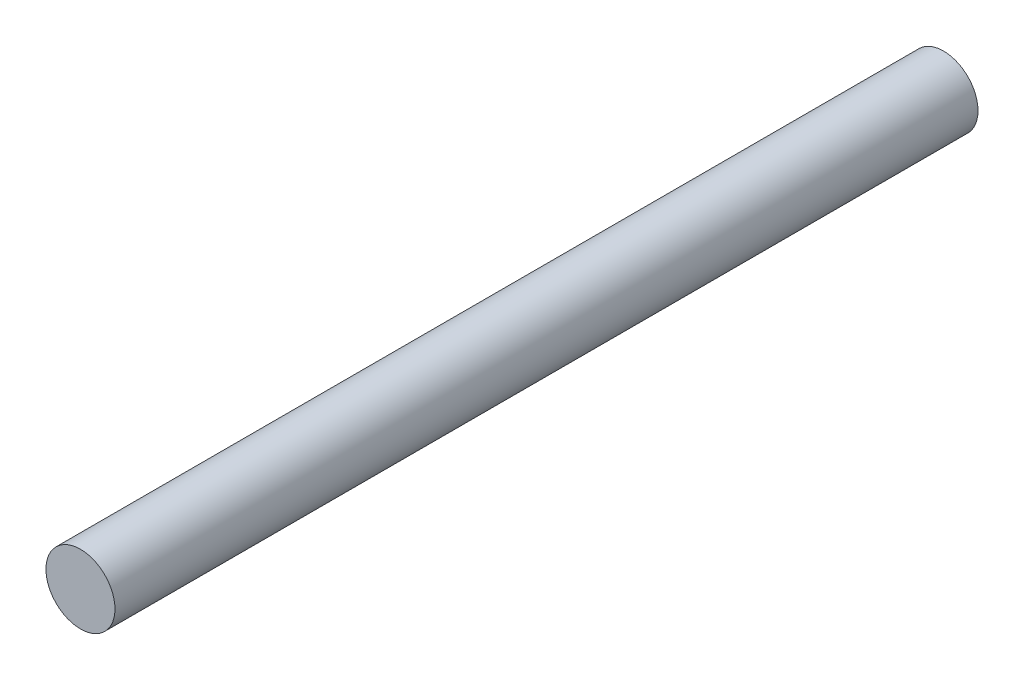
ISO-10303-21;
HEADER;
FILE_DESCRIPTION(('STEP AP214'),'2;1');
FILE_NAME('part.step','',(''),(''),'','','');
FILE_SCHEMA(('AUTOMOTIVE_DESIGN { 1 0 10303 214 1 1 1 1 }'));
ENDSEC;
DATA;
#1=APPLICATION_CONTEXT('core data for automotive mechanical design processes');
#2=APPLICATION_PROTOCOL_DEFINITION('international standard','automotive_design',2000,#1);
#3=PRODUCT_CONTEXT('',#1,'mechanical');
#4=PRODUCT('Part','Part','',(#3));
#5=PRODUCT_RELATED_PRODUCT_CATEGORY('part','',(#4));
#6=PRODUCT_DEFINITION_FORMATION('','',#4);
#7=PRODUCT_DEFINITION_CONTEXT('part definition',#1,'design');
#8=PRODUCT_DEFINITION('design','',#6,#7);
#9=PRODUCT_DEFINITION_SHAPE('','',#8);
#10=(LENGTH_UNIT() NAMED_UNIT(*) SI_UNIT(.MILLI.,.METRE.));
#11=(NAMED_UNIT(*) PLANE_ANGLE_UNIT() SI_UNIT($,.RADIAN.));
#12=(NAMED_UNIT(*) SI_UNIT($,.STERADIAN.) SOLID_ANGLE_UNIT());
#13=UNCERTAINTY_MEASURE_WITH_UNIT(LENGTH_MEASURE(1.E-05),#10,'distance_accuracy_value','');
#14=(GEOMETRIC_REPRESENTATION_CONTEXT(3) GLOBAL_UNCERTAINTY_ASSIGNED_CONTEXT((#13)) GLOBAL_UNIT_ASSIGNED_CONTEXT((#10,
#11,#12)) REPRESENTATION_CONTEXT('',''));
#15=CARTESIAN_POINT('',(0.,0.,0.));
#16=DIRECTION('',(0.,0.,1.));
#17=DIRECTION('',(1.,0.,0.));
#18=AXIS2_PLACEMENT_3D('',#15,#16,#17);
#19=CARTESIAN_POINT('',(4.9960036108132E-13,-1.99840144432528E-12,-1269.99999999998));
#20=DIRECTION('',(0.,0.,0.999999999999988));
#21=DIRECTION('',(0.999999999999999,0.,0.));
#22=AXIS2_PLACEMENT_3D('',#19,#20,#21);
#23=CYLINDRICAL_SURFACE('',#22,50.8);
#24=CARTESIAN_POINT('',(4.9960036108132E-13,-1.99840144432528E-12,-1269.99999999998));
#25=DIRECTION('',(0.,0.,0.999999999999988));
#26=DIRECTION('',(0.999999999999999,0.,0.));
#27=AXIS2_PLACEMENT_3D('',#24,#25,#26);
#28=CIRCLE('',#27,50.8);
#29=CARTESIAN_POINT('',(50.8000000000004,-1.99840365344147E-12,-1269.99999999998));
#30=VERTEX_POINT('',#29);
#31=EDGE_CURVE('E10',#30,#30,#28,.T.);
#32=CARTESIAN_POINT('',(0.,0.,0.));
#33=DIRECTION('',(0.,0.,0.999999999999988));
#34=DIRECTION('',(0.999999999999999,0.,0.));
#35=AXIS2_PLACEMENT_3D('',#32,#33,#34);
#36=CIRCLE('',#35,50.8);
#37=CARTESIAN_POINT('',(50.8000000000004,-1.99840365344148E-12,2.22044604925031E-13));
#38=VERTEX_POINT('',#37);
#39=EDGE_CURVE('E354',#38,#38,#36,.T.);
#40=CARTESIAN_POINT('',(50.8000000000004,-1.99840365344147E-12,-1269.99999999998));
#41=CARTESIAN_POINT('',(50.8000000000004,-1.99840365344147E-12,-1256.77083333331));
#42=CARTESIAN_POINT('',(50.8000000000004,-1.99840365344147E-12,-1243.54166666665));
#43=CARTESIAN_POINT('',(50.8000000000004,-1.99840365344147E-12,-1217.08333333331));
#44=CARTESIAN_POINT('',(50.8000000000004,-1.99840365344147E-12,-1203.85416666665));
#45=CARTESIAN_POINT('',(50.8000000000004,-1.99840365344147E-12,-1177.39583333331));
#46=CARTESIAN_POINT('',(50.8000000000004,-1.99840365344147E-12,-1164.16666666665));
#47=CARTESIAN_POINT('',(50.8000000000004,-1.99840365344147E-12,-1137.70833333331));
#48=CARTESIAN_POINT('',(50.8000000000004,-1.99840365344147E-12,-1124.47916666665));
#49=CARTESIAN_POINT('',(50.8000000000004,-1.99840365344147E-12,-1098.02083333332));
#50=CARTESIAN_POINT('',(50.8000000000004,-1.99840365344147E-12,-1084.79166666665));
#51=CARTESIAN_POINT('',(50.8000000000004,-1.99840365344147E-12,-1058.33333333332));
#52=CARTESIAN_POINT('',(50.8000000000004,-1.99840365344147E-12,-1045.10416666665));
#53=CARTESIAN_POINT('',(50.8000000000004,-1.99840365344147E-12,-1018.64583333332));
#54=CARTESIAN_POINT('',(50.8000000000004,-1.99840365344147E-12,-1005.41666666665));
#55=CARTESIAN_POINT('',(50.8000000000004,-1.99840365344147E-12,-978.958333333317));
#56=CARTESIAN_POINT('',(50.8000000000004,-1.99840365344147E-12,-965.729166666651));
#57=CARTESIAN_POINT('',(50.8000000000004,-1.99840365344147E-12,-939.270833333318));
#58=CARTESIAN_POINT('',(50.8000000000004,-1.99840365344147E-12,-926.041666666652));
#59=CARTESIAN_POINT('',(50.8000000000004,-1.99840365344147E-12,-899.583333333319));
#60=CARTESIAN_POINT('',(50.8000000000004,-1.99840365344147E-12,-886.354166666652));
#61=CARTESIAN_POINT('',(50.8000000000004,-1.99840365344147E-12,-859.895833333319));
#62=CARTESIAN_POINT('',(50.8000000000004,-1.99840365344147E-12,-846.666666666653));
#63=CARTESIAN_POINT('',(50.8000000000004,-1.99840365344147E-12,-820.20833333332));
#64=CARTESIAN_POINT('',(50.8000000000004,-1.99840365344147E-12,-806.979166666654));
#65=CARTESIAN_POINT('',(50.8000000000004,-1.99840365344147E-12,-780.520833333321));
#66=CARTESIAN_POINT('',(50.8000000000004,-1.99840365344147E-12,-767.291666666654));
#67=CARTESIAN_POINT('',(50.8000000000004,-1.99840365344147E-12,-740.833333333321));
#68=CARTESIAN_POINT('',(50.8000000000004,-1.99840365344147E-12,-727.604166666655));
#69=CARTESIAN_POINT('',(50.8000000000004,-1.99840365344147E-12,-701.145833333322));
#70=CARTESIAN_POINT('',(50.8000000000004,-1.99840365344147E-12,-687.916666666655));
#71=CARTESIAN_POINT('',(50.8000000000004,-1.99840365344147E-12,-661.458333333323));
#72=CARTESIAN_POINT('',(50.8000000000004,-1.99840365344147E-12,-648.229166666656));
#73=CARTESIAN_POINT('',(50.8000000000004,-1.99840365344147E-12,-621.770833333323));
#74=CARTESIAN_POINT('',(50.8000000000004,-1.99840365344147E-12,-608.541666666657));
#75=CARTESIAN_POINT('',(50.8000000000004,-1.99840365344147E-12,-582.083333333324));
#76=CARTESIAN_POINT('',(50.8000000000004,-1.99840365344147E-12,-568.854166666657));
#77=CARTESIAN_POINT('',(50.8000000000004,-1.99840365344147E-12,-542.395833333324));
#78=CARTESIAN_POINT('',(50.8000000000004,-1.99840365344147E-12,-529.166666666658));
#79=CARTESIAN_POINT('',(50.8000000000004,-1.99840365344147E-12,-502.708333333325));
#80=CARTESIAN_POINT('',(50.8000000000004,-1.99840365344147E-12,-489.479166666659));
#81=CARTESIAN_POINT('',(50.8000000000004,-1.99840365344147E-12,-463.020833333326));
#82=CARTESIAN_POINT('',(50.8000000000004,-1.99840365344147E-12,-449.791666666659));
#83=CARTESIAN_POINT('',(50.8000000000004,-1.99840365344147E-12,-423.333333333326));
#84=CARTESIAN_POINT('',(50.8000000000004,-1.99840365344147E-12,-410.10416666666));
#85=CARTESIAN_POINT('',(50.8000000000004,-1.99840365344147E-12,-383.645833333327));
#86=CARTESIAN_POINT('',(50.8000000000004,-1.99840365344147E-12,-370.416666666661));
#87=CARTESIAN_POINT('',(50.8000000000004,-1.99840365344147E-12,-343.958333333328));
#88=CARTESIAN_POINT('',(50.8000000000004,-1.99840365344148E-12,-330.729166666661));
#89=CARTESIAN_POINT('',(50.8000000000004,-1.99840365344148E-12,-304.270833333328));
#90=CARTESIAN_POINT('',(50.8000000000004,-1.99840365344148E-12,-291.041666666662));
#91=CARTESIAN_POINT('',(50.8000000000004,-1.99840365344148E-12,-264.583333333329));
#92=CARTESIAN_POINT('',(50.8000000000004,-1.99840365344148E-12,-251.354166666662));
#93=CARTESIAN_POINT('',(50.8000000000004,-1.99840365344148E-12,-224.895833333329));
#94=CARTESIAN_POINT('',(50.8000000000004,-1.99840365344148E-12,-211.666666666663));
#95=CARTESIAN_POINT('',(50.8000000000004,-1.99840365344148E-12,-185.20833333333));
#96=CARTESIAN_POINT('',(50.8000000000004,-1.99840365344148E-12,-171.979166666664));
#97=CARTESIAN_POINT('',(50.8000000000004,-1.99840365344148E-12,-145.520833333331));
#98=CARTESIAN_POINT('',(50.8000000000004,-1.99840365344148E-12,-132.291666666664));
#99=CARTESIAN_POINT('',(50.8000000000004,-1.99840365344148E-12,-105.833333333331));
#100=CARTESIAN_POINT('',(50.8000000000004,-1.99840365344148E-12,-92.604166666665));
#101=CARTESIAN_POINT('',(50.8000000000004,-1.99840365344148E-12,-66.1458333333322));
#102=CARTESIAN_POINT('',(50.8000000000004,-1.99840365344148E-12,-52.9166666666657));
#103=CARTESIAN_POINT('',(50.8000000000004,-1.99840365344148E-12,-26.4583333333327));
#104=CARTESIAN_POINT('',(50.8000000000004,-1.99840365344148E-12,-13.2291666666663));
#105=CARTESIAN_POINT('',(50.8000000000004,-1.99840365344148E-12,2.22044604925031E-13));
#106=B_SPLINE_CURVE_WITH_KNOTS('',3,(#40,#41,#42,#43,#44,#45,#46,#47,#48,#49,#50,#51,#52,#53,
#54,#55,#56,#57,#58,#59,#60,#61,#62,#63,#64,#65,#66,#67,#68,#69,#70,#71,#72,#73,#74,#75,#76,#77,
#78,#79,#80,#81,#82,#83,#84,#85,#86,#87,#88,#89,#90,#91,#92,#93,#94,#95,#96,#97,#98,#99,#100,
#101,#102,#103,#104,#105),.UNSPECIFIED.,.F.,.F.,(4,2,2,2,2,2,2,2,2,2,2,2,2,2,2,2,2,2,2,2,2,2,2,
2,2,2,2,2,2,2,2,2,4),(0.,39.6874999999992,79.3749999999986,119.062499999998,158.749999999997,
198.437499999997,238.124999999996,277.812499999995,317.499999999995,357.187499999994,
396.874999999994,436.562499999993,476.249999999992,515.937499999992,555.624999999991,
595.31249999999,634.99999999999,674.687499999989,714.374999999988,754.062499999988,
793.749999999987,833.437499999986,873.124999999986,912.812499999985,952.499999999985,
992.187499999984,1031.87499999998,1071.56249999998,1111.24999999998,1150.93749999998,
1190.62499999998,1230.31249999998,1269.99999999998),.UNSPECIFIED.);
#107=EDGE_CURVE('BSEAM348',#30,#38,#106,.T.);
#108=ORIENTED_EDGE('',*,*,#31,.T.);
#109=ORIENTED_EDGE('',*,*,#39,.F.);
#110=ORIENTED_EDGE('',*,*,#107,.T.);
#111=ORIENTED_EDGE('',*,*,#107,.F.);
#112=EDGE_LOOP('',(#108,#110,#109,#111));
#113=FACE_BOUND('',#112,.T.);
#114=ADVANCED_FACE('F348',(#113),#23,.T.);
#115=CARTESIAN_POINT('',(4.9960036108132E-13,-1.99840144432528E-12,-1269.99999999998));
#116=DIRECTION('',(0.,0.,0.999999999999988));
#117=DIRECTION('',(0.999999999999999,0.,0.));
#118=AXIS2_PLACEMENT_3D('',#115,#116,#117);
#119=PLANE('',#118);
#120=ORIENTED_EDGE('',*,*,#31,.F.);
#121=EDGE_LOOP('',(#120));
#122=FACE_BOUND('',#121,.T.);
#123=ADVANCED_FACE('F363',(#122),#119,.F.);
#124=CARTESIAN_POINT('',(0.,0.,0.));
#125=DIRECTION('',(0.,0.,0.999999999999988));
#126=DIRECTION('',(0.999999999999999,0.,0.));
#127=AXIS2_PLACEMENT_3D('',#124,#125,#126);
#128=PLANE('',#127);
#129=ORIENTED_EDGE('',*,*,#39,.T.);
#130=EDGE_LOOP('',(#129));
#131=FACE_BOUND('',#130,.T.);
#132=ADVANCED_FACE('F360',(#131),#128,.T.);
#133=CLOSED_SHELL('',(#114,#123,#132));
#134=MANIFOLD_SOLID_BREP('B2',#133);
#135=ADVANCED_BREP_SHAPE_REPRESENTATION('',(#18,#134),#14);
#136=SHAPE_DEFINITION_REPRESENTATION(#9,#135);
ENDSEC;
END-ISO-10303-21;
